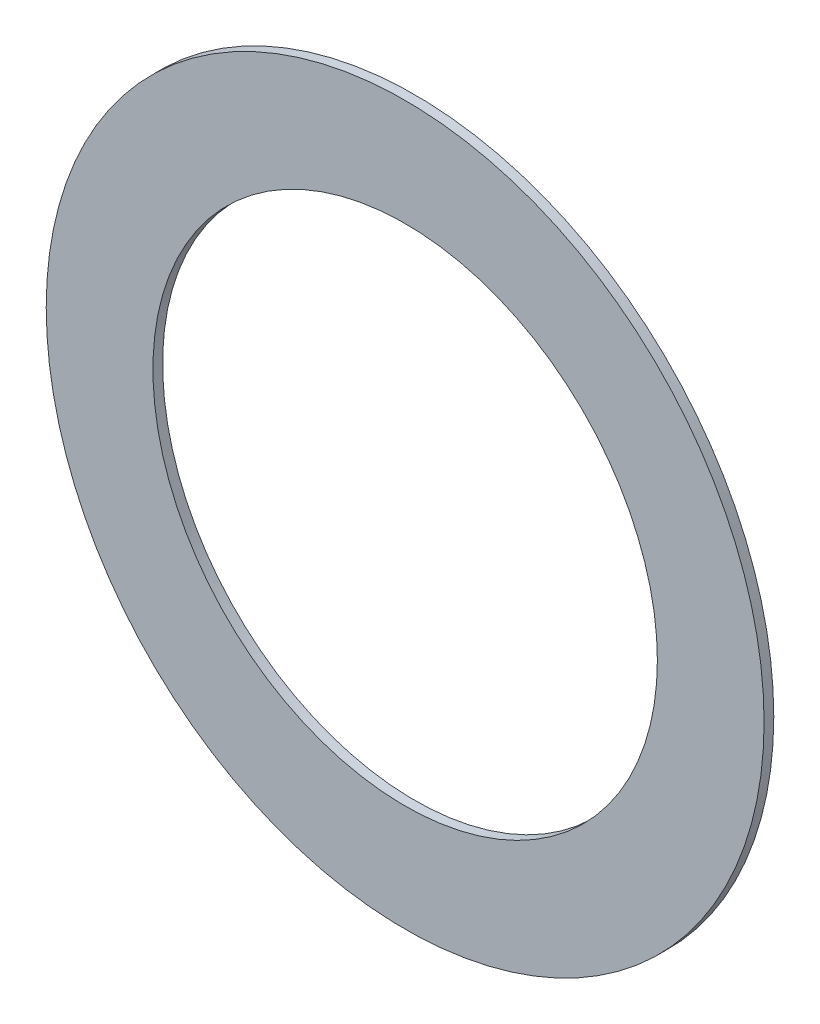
ISO-10303-21;
HEADER;
FILE_DESCRIPTION(('STEP AP214'),'2;1');
FILE_NAME('part.step','',(''),(''),'','','');
FILE_SCHEMA(('AUTOMOTIVE_DESIGN { 1 0 10303 214 1 1 1 1 }'));
ENDSEC;
DATA;
#1=APPLICATION_CONTEXT('core data for automotive mechanical design processes');
#2=APPLICATION_PROTOCOL_DEFINITION('international standard','automotive_design',2000,#1);
#3=PRODUCT_CONTEXT('',#1,'mechanical');
#4=PRODUCT('Part','Part','',(#3));
#5=PRODUCT_RELATED_PRODUCT_CATEGORY('part','',(#4));
#6=PRODUCT_DEFINITION_FORMATION('','',#4);
#7=PRODUCT_DEFINITION_CONTEXT('part definition',#1,'design');
#8=PRODUCT_DEFINITION('design','',#6,#7);
#9=PRODUCT_DEFINITION_SHAPE('','',#8);
#10=(LENGTH_UNIT() NAMED_UNIT(*) SI_UNIT(.MILLI.,.METRE.));
#11=(NAMED_UNIT(*) PLANE_ANGLE_UNIT() SI_UNIT($,.RADIAN.));
#12=(NAMED_UNIT(*) SI_UNIT($,.STERADIAN.) SOLID_ANGLE_UNIT());
#13=UNCERTAINTY_MEASURE_WITH_UNIT(LENGTH_MEASURE(1.E-05),#10,'distance_accuracy_value','');
#14=(GEOMETRIC_REPRESENTATION_CONTEXT(3) GLOBAL_UNCERTAINTY_ASSIGNED_CONTEXT((#13)) GLOBAL_UNIT_ASSIGNED_CONTEXT((#10,
#11,#12)) REPRESENTATION_CONTEXT('',''));
#15=CARTESIAN_POINT('',(0.,0.,0.));
#16=DIRECTION('',(0.,0.,1.));
#17=DIRECTION('',(1.,0.,0.));
#18=AXIS2_PLACEMENT_3D('',#15,#16,#17);
#19=CARTESIAN_POINT('',(0.,9.25,0.125000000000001));
#20=DIRECTION('',(0.,0.,-1.));
#21=DIRECTION('',(-1.,0.,0.));
#22=AXIS2_PLACEMENT_3D('',#19,#20,#21);
#23=PLANE('',#22);
#24=CARTESIAN_POINT('',(0.,0.,0.125000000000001));
#25=DIRECTION('',(0.,0.,1.));
#26=DIRECTION('',(1.,0.,0.));
#27=AXIS2_PLACEMENT_3D('',#24,#25,#26);
#28=CIRCLE('',#27,6.5);
#29=CARTESIAN_POINT('',(6.5,0.,0.125000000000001));
#30=VERTEX_POINT('',#29);
#31=EDGE_CURVE('E44',#30,#30,#28,.T.);
#32=ORIENTED_EDGE('',*,*,#31,.F.);
#33=EDGE_LOOP('',(#32));
#34=FACE_BOUND('',#33,.T.);
#35=CARTESIAN_POINT('',(0.,0.,0.125000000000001));
#36=DIRECTION('',(0.,0.,1.));
#37=DIRECTION('',(1.,0.,0.));
#38=AXIS2_PLACEMENT_3D('',#35,#36,#37);
#39=CIRCLE('',#38,9.25);
#40=CARTESIAN_POINT('',(9.25,0.,0.125000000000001));
#41=VERTEX_POINT('',#40);
#42=EDGE_CURVE('E10',#41,#41,#39,.T.);
#43=ORIENTED_EDGE('',*,*,#42,.T.);
#44=EDGE_LOOP('',(#43));
#45=FACE_BOUND('',#44,.T.);
#46=ADVANCED_FACE('F30',(#34,#45),#23,.F.);
#47=CARTESIAN_POINT('',(0.,0.,0.));
#48=DIRECTION('',(0.,0.,1.));
#49=DIRECTION('',(1.,0.,0.));
#50=AXIS2_PLACEMENT_3D('',#47,#48,#49);
#51=CYLINDRICAL_SURFACE('',#50,9.25);
#52=CARTESIAN_POINT('',(0.,0.,-0.124999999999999));
#53=DIRECTION('',(0.,0.,1.));
#54=DIRECTION('',(1.,0.,0.));
#55=AXIS2_PLACEMENT_3D('',#52,#53,#54);
#56=CIRCLE('',#55,9.25);
#57=CARTESIAN_POINT('',(9.25,0.,-0.124999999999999));
#58=VERTEX_POINT('',#57);
#59=EDGE_CURVE('E36',#58,#58,#56,.T.);
#60=ORIENTED_EDGE('',*,*,#59,.T.);
#61=EDGE_LOOP('',(#60));
#62=FACE_BOUND('',#61,.T.);
#63=ORIENTED_EDGE('',*,*,#42,.F.);
#64=EDGE_LOOP('',(#63));
#65=FACE_BOUND('',#64,.T.);
#66=ADVANCED_FACE('F54',(#62,#65),#51,.T.);
#67=CARTESIAN_POINT('',(0.,6.5,-0.124999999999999));
#68=DIRECTION('',(0.,0.,1.));
#69=DIRECTION('',(1.,0.,0.));
#70=AXIS2_PLACEMENT_3D('',#67,#68,#69);
#71=PLANE('',#70);
#72=ORIENTED_EDGE('',*,*,#59,.F.);
#73=EDGE_LOOP('',(#72));
#74=FACE_BOUND('',#73,.T.);
#75=CARTESIAN_POINT('',(0.,0.,-0.124999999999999));
#76=DIRECTION('',(0.,0.,1.));
#77=DIRECTION('',(1.,0.,0.));
#78=AXIS2_PLACEMENT_3D('',#75,#76,#77);
#79=CIRCLE('',#78,6.5);
#80=CARTESIAN_POINT('',(6.5,0.,-0.124999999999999));
#81=VERTEX_POINT('',#80);
#82=EDGE_CURVE('E40',#81,#81,#79,.T.);
#83=ORIENTED_EDGE('',*,*,#82,.T.);
#84=EDGE_LOOP('',(#83));
#85=FACE_BOUND('',#84,.T.);
#86=ADVANCED_FACE('F58',(#74,#85),#71,.F.);
#87=CARTESIAN_POINT('',(0.,0.,0.));
#88=DIRECTION('',(0.,0.,1.));
#89=DIRECTION('',(1.,0.,0.));
#90=AXIS2_PLACEMENT_3D('',#87,#88,#89);
#91=CYLINDRICAL_SURFACE('',#90,6.5);
#92=ORIENTED_EDGE('',*,*,#31,.T.);
#93=EDGE_LOOP('',(#92));
#94=FACE_BOUND('',#93,.T.);
#95=ORIENTED_EDGE('',*,*,#82,.F.);
#96=EDGE_LOOP('',(#95));
#97=FACE_BOUND('',#96,.T.);
#98=ADVANCED_FACE('F50',(#94,#97),#91,.F.);
#99=CLOSED_SHELL('',(#46,#66,#86,#98));
#100=MANIFOLD_SOLID_BREP('B2',#99);
#101=ADVANCED_BREP_SHAPE_REPRESENTATION('',(#18,#100),#14);
#102=SHAPE_DEFINITION_REPRESENTATION(#9,#101);
ENDSEC;
END-ISO-10303-21;
